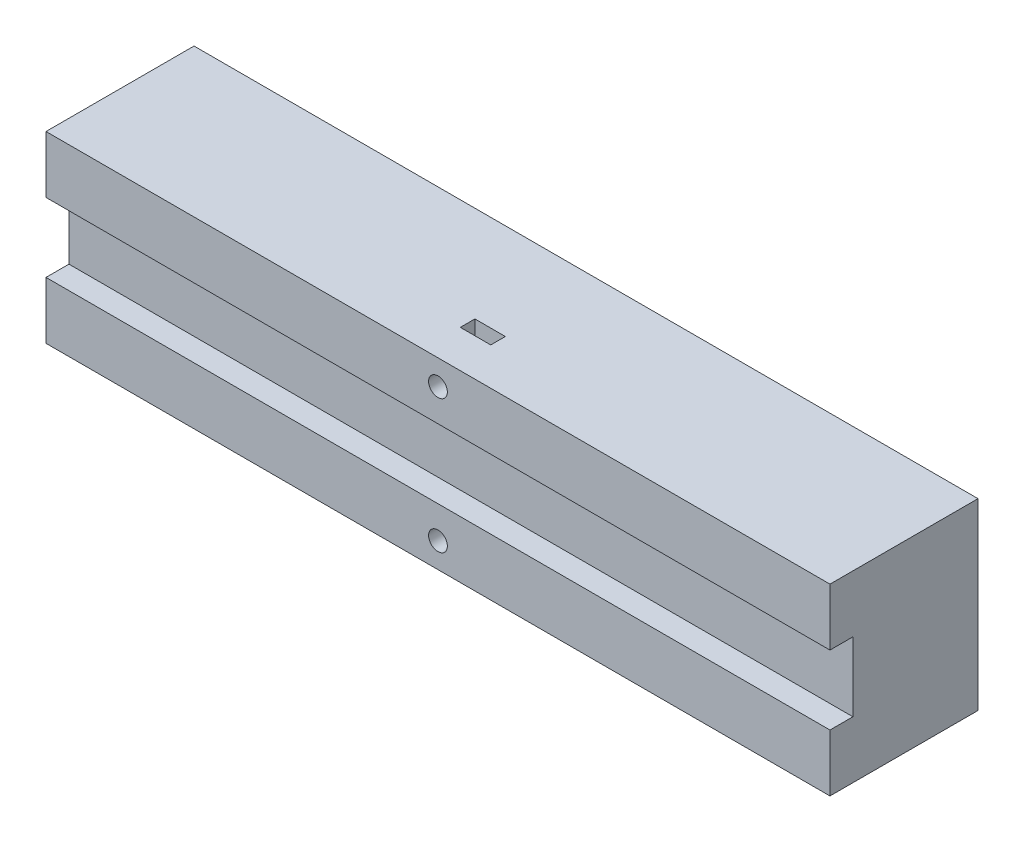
ISO-10303-21;
HEADER;
FILE_DESCRIPTION(('STEP AP214'),'2;1');
FILE_NAME('part.step','',(''),(''),'','','');
FILE_SCHEMA(('AUTOMOTIVE_DESIGN { 1 0 10303 214 1 1 1 1 }'));
ENDSEC;
DATA;
#1=APPLICATION_CONTEXT('core data for automotive mechanical design processes');
#2=APPLICATION_PROTOCOL_DEFINITION('international standard','automotive_design',2000,#1);
#3=PRODUCT_CONTEXT('',#1,'mechanical');
#4=PRODUCT('Part','Part','',(#3));
#5=PRODUCT_RELATED_PRODUCT_CATEGORY('part','',(#4));
#6=PRODUCT_DEFINITION_FORMATION('','',#4);
#7=PRODUCT_DEFINITION_CONTEXT('part definition',#1,'design');
#8=PRODUCT_DEFINITION('design','',#6,#7);
#9=PRODUCT_DEFINITION_SHAPE('','',#8);
#10=(LENGTH_UNIT() NAMED_UNIT(*) SI_UNIT(.MILLI.,.METRE.));
#11=(NAMED_UNIT(*) PLANE_ANGLE_UNIT() SI_UNIT($,.RADIAN.));
#12=(NAMED_UNIT(*) SI_UNIT($,.STERADIAN.) SOLID_ANGLE_UNIT());
#13=UNCERTAINTY_MEASURE_WITH_UNIT(LENGTH_MEASURE(1.E-05),#10,'distance_accuracy_value','');
#14=(GEOMETRIC_REPRESENTATION_CONTEXT(3) GLOBAL_UNCERTAINTY_ASSIGNED_CONTEXT((#13)) GLOBAL_UNIT_ASSIGNED_CONTEXT((#10,
#11,#12)) REPRESENTATION_CONTEXT('',''));
#15=CARTESIAN_POINT('',(0.,0.,0.));
#16=DIRECTION('',(0.,0.,1.));
#17=DIRECTION('',(1.,0.,0.));
#18=AXIS2_PLACEMENT_3D('',#15,#16,#17);
#19=CARTESIAN_POINT('',(0.,0.,23.));
#20=DIRECTION('',(0.,0.,1.));
#21=DIRECTION('',(1.,0.,0.));
#22=AXIS2_PLACEMENT_3D('',#19,#20,#21);
#23=PLANE('',#22);
#24=DIRECTION('',(0.,1.,0.));
#25=VECTOR('',#24,1.);
#26=CARTESIAN_POINT('',(-3.65,11.75,23.));
#27=LINE('',#26,#25);
#28=CARTESIAN_POINT('',(-3.65,11.75,23.));
#29=VERTEX_POINT('',#28);
#30=CARTESIAN_POINT('',(-3.65,22.,23.));
#31=VERTEX_POINT('',#30);
#32=EDGE_CURVE('E230',#29,#31,#27,.T.);
#33=ORIENTED_EDGE('',*,*,#32,.F.);
#34=DIRECTION('',(-1.,0.,0.));
#35=VECTOR('',#34,1.);
#36=CARTESIAN_POINT('',(3.65,11.75,23.));
#37=LINE('',#36,#35);
#38=CARTESIAN_POINT('',(3.65,11.75,23.));
#39=VERTEX_POINT('',#38);
#40=EDGE_CURVE('E257',#39,#29,#37,.T.);
#41=ORIENTED_EDGE('',*,*,#40,.F.);
#42=DIRECTION('',(0.,-1.,0.));
#43=VECTOR('',#42,1.);
#44=CARTESIAN_POINT('',(3.65,22.,23.));
#45=LINE('',#44,#43);
#46=CARTESIAN_POINT('',(3.65,22.,23.));
#47=VERTEX_POINT('',#46);
#48=EDGE_CURVE('E254',#47,#39,#45,.T.);
#49=ORIENTED_EDGE('',*,*,#48,.F.);
#50=DIRECTION('',(-1.,0.,0.));
#51=VECTOR('',#50,1.);
#52=CARTESIAN_POINT('',(94.,22.,23.));
#53=LINE('',#52,#51);
#54=EDGE_CURVE('E299',#47,#31,#53,.T.);
#55=ORIENTED_EDGE('',*,*,#54,.T.);
#56=EDGE_LOOP('',(#33,#41,#49,#55));
#57=FACE_BOUND('',#56,.T.);
#58=CARTESIAN_POINT('',(0.,16.,23.));
#59=DIRECTION('',(0.,0.,1.));
#60=DIRECTION('',(1.,0.,0.));
#61=AXIS2_PLACEMENT_3D('',#58,#59,#60);
#62=CIRCLE('',#61,2.25);
#63=CARTESIAN_POINT('',(2.25,16.,23.));
#64=VERTEX_POINT('',#63);
#65=EDGE_CURVE('E286',#64,#64,#62,.T.);
#66=ORIENTED_EDGE('',*,*,#65,.F.);
#67=EDGE_LOOP('',(#66));
#68=FACE_BOUND('',#67,.T.);
#69=ADVANCED_FACE('F43',(#57,#68),#23,.T.);
#70=DIRECTION('',(0.,-1.,0.));
#71=VECTOR('',#70,1.);
#72=CARTESIAN_POINT('',(3.65,-11.75,23.));
#73=LINE('',#72,#71);
#74=CARTESIAN_POINT('',(3.65,-11.75,23.));
#75=VERTEX_POINT('',#74);
#76=CARTESIAN_POINT('',(3.65,-22.,23.));
#77=VERTEX_POINT('',#76);
#78=EDGE_CURVE('E251',#75,#77,#73,.T.);
#79=ORIENTED_EDGE('',*,*,#78,.F.);
#80=DIRECTION('',(1.,0.,0.));
#81=VECTOR('',#80,1.);
#82=CARTESIAN_POINT('',(-3.65,-11.75,23.));
#83=LINE('',#82,#81);
#84=CARTESIAN_POINT('',(-3.65,-11.75,23.));
#85=VERTEX_POINT('',#84);
#86=EDGE_CURVE('E248',#85,#75,#83,.T.);
#87=ORIENTED_EDGE('',*,*,#86,.F.);
#88=DIRECTION('',(0.,1.,0.));
#89=VECTOR('',#88,1.);
#90=CARTESIAN_POINT('',(-3.65,-22.,23.));
#91=LINE('',#90,#89);
#92=CARTESIAN_POINT('',(-3.65,-22.,23.));
#93=VERTEX_POINT('',#92);
#94=EDGE_CURVE('E221',#93,#85,#91,.T.);
#95=ORIENTED_EDGE('',*,*,#94,.F.);
#96=DIRECTION('',(1.,0.,0.));
#97=VECTOR('',#96,1.);
#98=CARTESIAN_POINT('',(-94.,-22.,23.));
#99=LINE('',#98,#97);
#100=EDGE_CURVE('E297',#93,#77,#99,.T.);
#101=ORIENTED_EDGE('',*,*,#100,.T.);
#102=EDGE_LOOP('',(#79,#87,#95,#101));
#103=FACE_BOUND('',#102,.T.);
#104=CARTESIAN_POINT('',(0.,-16.,23.));
#105=DIRECTION('',(0.,0.,1.));
#106=DIRECTION('',(1.,0.,0.));
#107=AXIS2_PLACEMENT_3D('',#104,#105,#106);
#108=CIRCLE('',#107,2.25);
#109=CARTESIAN_POINT('',(2.25,-16.,23.));
#110=VERTEX_POINT('',#109);
#111=EDGE_CURVE('E292',#110,#110,#108,.T.);
#112=ORIENTED_EDGE('',*,*,#111,.F.);
#113=EDGE_LOOP('',(#112));
#114=FACE_BOUND('',#113,.T.);
#115=ADVANCED_FACE('F344',(#103,#114),#23,.T.);
#116=CARTESIAN_POINT('',(0.,0.,0.));
#117=DIRECTION('',(0.,0.,1.));
#118=DIRECTION('',(1.,0.,0.));
#119=AXIS2_PLACEMENT_3D('',#116,#117,#118);
#120=PLANE('',#119);
#121=DIRECTION('',(0.,-1.,0.));
#122=VECTOR('',#121,1.);
#123=CARTESIAN_POINT('',(-94.,22.,0.));
#124=LINE('',#123,#122);
#125=CARTESIAN_POINT('',(-94.,22.,0.));
#126=VERTEX_POINT('',#125);
#127=CARTESIAN_POINT('',(-94.,-22.,0.));
#128=VERTEX_POINT('',#127);
#129=EDGE_CURVE('E161',#126,#128,#124,.T.);
#130=ORIENTED_EDGE('',*,*,#129,.F.);
#131=DIRECTION('',(-1.,0.,0.));
#132=VECTOR('',#131,1.);
#133=CARTESIAN_POINT('',(94.,22.,0.));
#134=LINE('',#133,#132);
#135=CARTESIAN_POINT('',(94.,22.,0.));
#136=VERTEX_POINT('',#135);
#137=EDGE_CURVE('E300',#136,#126,#134,.T.);
#138=ORIENTED_EDGE('',*,*,#137,.F.);
#139=DIRECTION('',(0.,1.,0.));
#140=VECTOR('',#139,1.);
#141=CARTESIAN_POINT('',(94.,-22.,0.));
#142=LINE('',#141,#140);
#143=CARTESIAN_POINT('',(94.,-22.,0.));
#144=VERTEX_POINT('',#143);
#145=EDGE_CURVE('E306',#144,#136,#142,.T.);
#146=ORIENTED_EDGE('',*,*,#145,.F.);
#147=DIRECTION('',(1.,0.,0.));
#148=VECTOR('',#147,1.);
#149=CARTESIAN_POINT('',(-94.,-22.,0.));
#150=LINE('',#149,#148);
#151=EDGE_CURVE('E304',#128,#144,#150,.T.);
#152=ORIENTED_EDGE('',*,*,#151,.F.);
#153=EDGE_LOOP('',(#130,#138,#146,#152));
#154=FACE_BOUND('',#153,.T.);
#155=CARTESIAN_POINT('',(0.,-16.,0.));
#156=DIRECTION('',(0.,0.,1.));
#157=DIRECTION('',(1.,0.,0.));
#158=AXIS2_PLACEMENT_3D('',#155,#156,#157);
#159=CIRCLE('',#158,2.25);
#160=CARTESIAN_POINT('',(2.25,-16.,0.));
#161=VERTEX_POINT('',#160);
#162=EDGE_CURVE('E289',#161,#161,#159,.T.);
#163=ORIENTED_EDGE('',*,*,#162,.T.);
#164=EDGE_LOOP('',(#163));
#165=FACE_BOUND('',#164,.T.);
#166=CARTESIAN_POINT('',(0.,16.,0.));
#167=DIRECTION('',(0.,0.,1.));
#168=DIRECTION('',(1.,0.,0.));
#169=AXIS2_PLACEMENT_3D('',#166,#167,#168);
#170=CIRCLE('',#169,2.25);
#171=CARTESIAN_POINT('',(2.25,16.,0.));
#172=VERTEX_POINT('',#171);
#173=EDGE_CURVE('E285',#172,#172,#170,.T.);
#174=ORIENTED_EDGE('',*,*,#173,.T.);
#175=EDGE_LOOP('',(#174));
#176=FACE_BOUND('',#175,.T.);
#177=ADVANCED_FACE('F318',(#154,#165,#176),#120,.F.);
#178=CARTESIAN_POINT('',(-94.,22.,23.));
#179=DIRECTION('',(1.,0.,0.));
#180=DIRECTION('',(0.,0.,-1.));
#181=AXIS2_PLACEMENT_3D('',#178,#179,#180);
#182=PLANE('',#181);
#183=ORIENTED_EDGE('',*,*,#129,.T.);
#184=DIRECTION('',(0.,0.,-1.));
#185=VECTOR('',#184,1.);
#186=CARTESIAN_POINT('',(-94.,-22.,23.));
#187=LINE('',#186,#185);
#188=CARTESIAN_POINT('',(-94.,-22.,35.5));
#189=VERTEX_POINT('',#188);
#190=EDGE_CURVE('E11',#189,#128,#187,.T.);
#191=ORIENTED_EDGE('',*,*,#190,.F.);
#192=DIRECTION('',(0.,-1.,0.));
#193=VECTOR('',#192,1.);
#194=CARTESIAN_POINT('',(-94.,-8.3,35.5));
#195=LINE('',#194,#193);
#196=CARTESIAN_POINT('',(-94.,-8.3,35.5));
#197=VERTEX_POINT('',#196);
#198=EDGE_CURVE('E158',#197,#189,#195,.T.);
#199=ORIENTED_EDGE('',*,*,#198,.F.);
#200=DIRECTION('',(0.,0.,-1.));
#201=VECTOR('',#200,1.);
#202=CARTESIAN_POINT('',(-94.,-8.3,35.5));
#203=LINE('',#202,#201);
#204=CARTESIAN_POINT('',(-94.,-8.3,30.));
#205=VERTEX_POINT('',#204);
#206=EDGE_CURVE('E182',#197,#205,#203,.T.);
#207=ORIENTED_EDGE('',*,*,#206,.T.);
#208=DIRECTION('',(0.,-1.,0.));
#209=VECTOR('',#208,1.);
#210=CARTESIAN_POINT('',(-94.,22.,30.));
#211=LINE('',#210,#209);
#212=CARTESIAN_POINT('',(-94.,8.3,30.));
#213=VERTEX_POINT('',#212);
#214=EDGE_CURVE('E216',#213,#205,#211,.T.);
#215=ORIENTED_EDGE('',*,*,#214,.F.);
#216=DIRECTION('',(0.,0.,-1.));
#217=VECTOR('',#216,1.);
#218=CARTESIAN_POINT('',(-94.,8.3,35.5));
#219=LINE('',#218,#217);
#220=CARTESIAN_POINT('',(-94.,8.3,35.5));
#221=VERTEX_POINT('',#220);
#222=EDGE_CURVE('E189',#221,#213,#219,.T.);
#223=ORIENTED_EDGE('',*,*,#222,.F.);
#224=DIRECTION('',(0.,-1.,0.));
#225=VECTOR('',#224,1.);
#226=CARTESIAN_POINT('',(-94.,22.,35.5));
#227=LINE('',#226,#225);
#228=CARTESIAN_POINT('',(-94.,22.,35.5));
#229=VERTEX_POINT('',#228);
#230=EDGE_CURVE('E198',#229,#221,#227,.T.);
#231=ORIENTED_EDGE('',*,*,#230,.F.);
#232=DIRECTION('',(0.,0.,-1.));
#233=VECTOR('',#232,1.);
#234=CARTESIAN_POINT('',(-94.,22.,23.));
#235=LINE('',#234,#233);
#236=EDGE_CURVE('E302',#229,#126,#235,.T.);
#237=ORIENTED_EDGE('',*,*,#236,.T.);
#238=EDGE_LOOP('',(#183,#191,#199,#207,#215,#223,#231,#237));
#239=FACE_BOUND('',#238,.T.);
#240=ADVANCED_FACE('F45',(#239),#182,.F.);
#241=CARTESIAN_POINT('',(-94.,-22.,23.));
#242=DIRECTION('',(0.,1.,0.));
#243=DIRECTION('',(0.,0.,1.));
#244=AXIS2_PLACEMENT_3D('',#241,#242,#243);
#245=PLANE('',#244);
#246=DIRECTION('',(0.,0.,-1.));
#247=VECTOR('',#246,1.);
#248=CARTESIAN_POINT('',(-3.65,-22.,26.5));
#249=LINE('',#248,#247);
#250=CARTESIAN_POINT('',(-3.65,-22.,26.5));
#251=VERTEX_POINT('',#250);
#252=EDGE_CURVE('E282',#251,#93,#249,.T.);
#253=ORIENTED_EDGE('',*,*,#252,.F.);
#254=DIRECTION('',(1.,0.,0.));
#255=VECTOR('',#254,1.);
#256=CARTESIAN_POINT('',(-94.,-22.,26.5));
#257=LINE('',#256,#255);
#258=CARTESIAN_POINT('',(3.65,-22.,26.5));
#259=VERTEX_POINT('',#258);
#260=EDGE_CURVE('E215',#251,#259,#257,.T.);
#261=ORIENTED_EDGE('',*,*,#260,.T.);
#262=DIRECTION('',(0.,0.,-1.));
#263=VECTOR('',#262,1.);
#264=CARTESIAN_POINT('',(3.65,-22.,26.5));
#265=LINE('',#264,#263);
#266=EDGE_CURVE('E273',#259,#77,#265,.T.);
#267=ORIENTED_EDGE('',*,*,#266,.T.);
#268=ORIENTED_EDGE('',*,*,#100,.F.);
#269=EDGE_LOOP('',(#253,#261,#267,#268));
#270=FACE_BOUND('',#269,.T.);
#271=ORIENTED_EDGE('',*,*,#151,.T.);
#272=DIRECTION('',(0.,0.,-1.));
#273=VECTOR('',#272,1.);
#274=CARTESIAN_POINT('',(94.,-22.,23.));
#275=LINE('',#274,#273);
#276=CARTESIAN_POINT('',(94.,-22.,35.5));
#277=VERTEX_POINT('',#276);
#278=EDGE_CURVE('E51',#277,#144,#275,.T.);
#279=ORIENTED_EDGE('',*,*,#278,.F.);
#280=DIRECTION('',(1.,0.,0.));
#281=VECTOR('',#280,1.);
#282=CARTESIAN_POINT('',(-94.,-22.,35.5));
#283=LINE('',#282,#281);
#284=EDGE_CURVE('E164',#189,#277,#283,.T.);
#285=ORIENTED_EDGE('',*,*,#284,.F.);
#286=ORIENTED_EDGE('',*,*,#190,.T.);
#287=EDGE_LOOP('',(#271,#279,#285,#286));
#288=FACE_BOUND('',#287,.T.);
#289=ADVANCED_FACE('F165',(#270,#288),#245,.F.);
#290=CARTESIAN_POINT('',(94.,-22.,23.));
#291=DIRECTION('',(-1.,0.,0.));
#292=DIRECTION('',(0.,0.,1.));
#293=AXIS2_PLACEMENT_3D('',#290,#291,#292);
#294=PLANE('',#293);
#295=ORIENTED_EDGE('',*,*,#145,.T.);
#296=DIRECTION('',(0.,0.,-1.));
#297=VECTOR('',#296,1.);
#298=CARTESIAN_POINT('',(94.,22.,23.));
#299=LINE('',#298,#297);
#300=CARTESIAN_POINT('',(94.,22.,35.5));
#301=VERTEX_POINT('',#300);
#302=EDGE_CURVE('E310',#301,#136,#299,.T.);
#303=ORIENTED_EDGE('',*,*,#302,.F.);
#304=DIRECTION('',(0.,1.,0.));
#305=VECTOR('',#304,1.);
#306=CARTESIAN_POINT('',(94.,8.3,35.5));
#307=LINE('',#306,#305);
#308=CARTESIAN_POINT('',(94.,8.3,35.5));
#309=VERTEX_POINT('',#308);
#310=EDGE_CURVE('E201',#309,#301,#307,.T.);
#311=ORIENTED_EDGE('',*,*,#310,.F.);
#312=DIRECTION('',(0.,0.,-1.));
#313=VECTOR('',#312,1.);
#314=CARTESIAN_POINT('',(94.,8.3,35.5));
#315=LINE('',#314,#313);
#316=CARTESIAN_POINT('',(94.,8.3,30.));
#317=VERTEX_POINT('',#316);
#318=EDGE_CURVE('E192',#309,#317,#315,.T.);
#319=ORIENTED_EDGE('',*,*,#318,.T.);
#320=DIRECTION('',(0.,1.,0.));
#321=VECTOR('',#320,1.);
#322=CARTESIAN_POINT('',(94.,-22.,30.));
#323=LINE('',#322,#321);
#324=CARTESIAN_POINT('',(94.,-8.3,30.));
#325=VERTEX_POINT('',#324);
#326=EDGE_CURVE('E218',#325,#317,#323,.T.);
#327=ORIENTED_EDGE('',*,*,#326,.F.);
#328=DIRECTION('',(0.,0.,-1.));
#329=VECTOR('',#328,1.);
#330=CARTESIAN_POINT('',(94.,-8.3,35.5));
#331=LINE('',#330,#329);
#332=CARTESIAN_POINT('',(94.,-8.3,35.5));
#333=VERTEX_POINT('',#332);
#334=EDGE_CURVE('E185',#333,#325,#331,.T.);
#335=ORIENTED_EDGE('',*,*,#334,.F.);
#336=DIRECTION('',(0.,1.,0.));
#337=VECTOR('',#336,1.);
#338=CARTESIAN_POINT('',(94.,-22.,35.5));
#339=LINE('',#338,#337);
#340=EDGE_CURVE('E169',#277,#333,#339,.T.);
#341=ORIENTED_EDGE('',*,*,#340,.F.);
#342=ORIENTED_EDGE('',*,*,#278,.T.);
#343=EDGE_LOOP('',(#295,#303,#311,#319,#327,#335,#341,#342));
#344=FACE_BOUND('',#343,.T.);
#345=ADVANCED_FACE('F314',(#344),#294,.F.);
#346=CARTESIAN_POINT('',(94.,22.,23.));
#347=DIRECTION('',(0.,-1.,0.));
#348=DIRECTION('',(0.,0.,-1.));
#349=AXIS2_PLACEMENT_3D('',#346,#347,#348);
#350=PLANE('',#349);
#351=DIRECTION('',(0.,0.,-1.));
#352=VECTOR('',#351,1.);
#353=CARTESIAN_POINT('',(3.65,22.,26.5));
#354=LINE('',#353,#352);
#355=CARTESIAN_POINT('',(3.65,22.,26.5));
#356=VERTEX_POINT('',#355);
#357=EDGE_CURVE('E270',#356,#47,#354,.T.);
#358=ORIENTED_EDGE('',*,*,#357,.F.);
#359=DIRECTION('',(-1.,0.,0.));
#360=VECTOR('',#359,1.);
#361=CARTESIAN_POINT('',(94.,22.,26.5));
#362=LINE('',#361,#360);
#363=CARTESIAN_POINT('',(-3.65,22.,26.5));
#364=VERTEX_POINT('',#363);
#365=EDGE_CURVE('E219',#356,#364,#362,.T.);
#366=ORIENTED_EDGE('',*,*,#365,.T.);
#367=DIRECTION('',(0.,0.,-1.));
#368=VECTOR('',#367,1.);
#369=CARTESIAN_POINT('',(-3.65,22.,26.5));
#370=LINE('',#369,#368);
#371=EDGE_CURVE('E245',#364,#31,#370,.T.);
#372=ORIENTED_EDGE('',*,*,#371,.T.);
#373=ORIENTED_EDGE('',*,*,#54,.F.);
#374=EDGE_LOOP('',(#358,#366,#372,#373));
#375=FACE_BOUND('',#374,.T.);
#376=ORIENTED_EDGE('',*,*,#137,.T.);
#377=ORIENTED_EDGE('',*,*,#236,.F.);
#378=DIRECTION('',(-1.,0.,0.));
#379=VECTOR('',#378,1.);
#380=CARTESIAN_POINT('',(94.,22.,35.5));
#381=LINE('',#380,#379);
#382=EDGE_CURVE('E195',#301,#229,#381,.T.);
#383=ORIENTED_EDGE('',*,*,#382,.F.);
#384=ORIENTED_EDGE('',*,*,#302,.T.);
#385=EDGE_LOOP('',(#376,#377,#383,#384));
#386=FACE_BOUND('',#385,.T.);
#387=ADVANCED_FACE('F321',(#375,#386),#350,.F.);
#388=CARTESIAN_POINT('',(0.,-16.,23.));
#389=DIRECTION('',(0.,0.,-1.));
#390=DIRECTION('',(-1.,0.,0.));
#391=AXIS2_PLACEMENT_3D('',#388,#389,#390);
#392=CYLINDRICAL_SURFACE('',#391,2.25);
#393=ORIENTED_EDGE('',*,*,#111,.T.);
#394=EDGE_LOOP('',(#393));
#395=FACE_BOUND('',#394,.T.);
#396=ORIENTED_EDGE('',*,*,#162,.F.);
#397=EDGE_LOOP('',(#396));
#398=FACE_BOUND('',#397,.T.);
#399=ADVANCED_FACE('F355',(#395,#398),#392,.F.);
#400=CARTESIAN_POINT('',(0.,16.,23.));
#401=DIRECTION('',(0.,0.,-1.));
#402=DIRECTION('',(-1.,0.,0.));
#403=AXIS2_PLACEMENT_3D('',#400,#401,#402);
#404=CYLINDRICAL_SURFACE('',#403,2.25);
#405=ORIENTED_EDGE('',*,*,#65,.T.);
#406=EDGE_LOOP('',(#405));
#407=FACE_BOUND('',#406,.T.);
#408=ORIENTED_EDGE('',*,*,#173,.F.);
#409=EDGE_LOOP('',(#408));
#410=FACE_BOUND('',#409,.T.);
#411=ADVANCED_FACE('F390',(#407,#410),#404,.F.);
#412=CARTESIAN_POINT('',(-3.65,-22.,26.5));
#413=DIRECTION('',(-1.,0.,0.));
#414=DIRECTION('',(0.,0.,1.));
#415=AXIS2_PLACEMENT_3D('',#412,#413,#414);
#416=PLANE('',#415);
#417=ORIENTED_EDGE('',*,*,#94,.T.);
#418=DIRECTION('',(0.,0.,-1.));
#419=VECTOR('',#418,1.);
#420=CARTESIAN_POINT('',(-3.65,-11.75,26.5));
#421=LINE('',#420,#419);
#422=CARTESIAN_POINT('',(-3.65,-11.75,26.5));
#423=VERTEX_POINT('',#422);
#424=EDGE_CURVE('E279',#423,#85,#421,.T.);
#425=ORIENTED_EDGE('',*,*,#424,.F.);
#426=DIRECTION('',(0.,1.,0.));
#427=VECTOR('',#426,1.);
#428=CARTESIAN_POINT('',(-3.65,-22.,26.5));
#429=LINE('',#428,#427);
#430=EDGE_CURVE('E226',#251,#423,#429,.T.);
#431=ORIENTED_EDGE('',*,*,#430,.F.);
#432=ORIENTED_EDGE('',*,*,#252,.T.);
#433=EDGE_LOOP('',(#417,#425,#431,#432));
#434=FACE_BOUND('',#433,.T.);
#435=ADVANCED_FACE('F372',(#434),#416,.F.);
#436=CARTESIAN_POINT('',(-3.65,-11.75,26.5));
#437=DIRECTION('',(0.,1.,0.));
#438=DIRECTION('',(0.,0.,1.));
#439=AXIS2_PLACEMENT_3D('',#436,#437,#438);
#440=PLANE('',#439);
#441=ORIENTED_EDGE('',*,*,#86,.T.);
#442=DIRECTION('',(0.,0.,-1.));
#443=VECTOR('',#442,1.);
#444=CARTESIAN_POINT('',(3.65,-11.75,26.5));
#445=LINE('',#444,#443);
#446=CARTESIAN_POINT('',(3.65,-11.75,26.5));
#447=VERTEX_POINT('',#446);
#448=EDGE_CURVE('E276',#447,#75,#445,.T.);
#449=ORIENTED_EDGE('',*,*,#448,.F.);
#450=DIRECTION('',(1.,0.,0.));
#451=VECTOR('',#450,1.);
#452=CARTESIAN_POINT('',(-3.65,-11.75,26.5));
#453=LINE('',#452,#451);
#454=EDGE_CURVE('E229',#423,#447,#453,.T.);
#455=ORIENTED_EDGE('',*,*,#454,.F.);
#456=ORIENTED_EDGE('',*,*,#424,.T.);
#457=EDGE_LOOP('',(#441,#449,#455,#456));
#458=FACE_BOUND('',#457,.T.);
#459=ADVANCED_FACE('F381',(#458),#440,.F.);
#460=CARTESIAN_POINT('',(3.65,-11.75,26.5));
#461=DIRECTION('',(1.,0.,0.));
#462=DIRECTION('',(0.,0.,-1.));
#463=AXIS2_PLACEMENT_3D('',#460,#461,#462);
#464=PLANE('',#463);
#465=ORIENTED_EDGE('',*,*,#78,.T.);
#466=ORIENTED_EDGE('',*,*,#266,.F.);
#467=DIRECTION('',(0.,-1.,0.));
#468=VECTOR('',#467,1.);
#469=CARTESIAN_POINT('',(3.65,-11.75,26.5));
#470=LINE('',#469,#468);
#471=EDGE_CURVE('E233',#447,#259,#470,.T.);
#472=ORIENTED_EDGE('',*,*,#471,.F.);
#473=ORIENTED_EDGE('',*,*,#448,.T.);
#474=EDGE_LOOP('',(#465,#466,#472,#473));
#475=FACE_BOUND('',#474,.T.);
#476=ADVANCED_FACE('F378',(#475),#464,.F.);
#477=CARTESIAN_POINT('',(3.65,22.,26.5));
#478=DIRECTION('',(1.,0.,0.));
#479=DIRECTION('',(0.,0.,-1.));
#480=AXIS2_PLACEMENT_3D('',#477,#478,#479);
#481=PLANE('',#480);
#482=ORIENTED_EDGE('',*,*,#48,.T.);
#483=DIRECTION('',(0.,0.,-1.));
#484=VECTOR('',#483,1.);
#485=CARTESIAN_POINT('',(3.65,11.75,26.5));
#486=LINE('',#485,#484);
#487=CARTESIAN_POINT('',(3.65,11.75,26.5));
#488=VERTEX_POINT('',#487);
#489=EDGE_CURVE('E267',#488,#39,#486,.T.);
#490=ORIENTED_EDGE('',*,*,#489,.F.);
#491=DIRECTION('',(0.,-1.,0.));
#492=VECTOR('',#491,1.);
#493=CARTESIAN_POINT('',(3.65,22.,26.5));
#494=LINE('',#493,#492);
#495=EDGE_CURVE('E236',#356,#488,#494,.T.);
#496=ORIENTED_EDGE('',*,*,#495,.F.);
#497=ORIENTED_EDGE('',*,*,#357,.T.);
#498=EDGE_LOOP('',(#482,#490,#496,#497));
#499=FACE_BOUND('',#498,.T.);
#500=ADVANCED_FACE('F388',(#499),#481,.F.);
#501=CARTESIAN_POINT('',(3.65,11.75,26.5));
#502=DIRECTION('',(0.,-1.,0.));
#503=DIRECTION('',(0.,0.,-1.));
#504=AXIS2_PLACEMENT_3D('',#501,#502,#503);
#505=PLANE('',#504);
#506=ORIENTED_EDGE('',*,*,#40,.T.);
#507=DIRECTION('',(0.,0.,-1.));
#508=VECTOR('',#507,1.);
#509=CARTESIAN_POINT('',(-3.65,11.75,26.5));
#510=LINE('',#509,#508);
#511=CARTESIAN_POINT('',(-3.65,11.75,26.5));
#512=VERTEX_POINT('',#511);
#513=EDGE_CURVE('E264',#512,#29,#510,.T.);
#514=ORIENTED_EDGE('',*,*,#513,.F.);
#515=DIRECTION('',(-1.,0.,0.));
#516=VECTOR('',#515,1.);
#517=CARTESIAN_POINT('',(3.65,11.75,26.5));
#518=LINE('',#517,#516);
#519=EDGE_CURVE('E239',#488,#512,#518,.T.);
#520=ORIENTED_EDGE('',*,*,#519,.F.);
#521=ORIENTED_EDGE('',*,*,#489,.T.);
#522=EDGE_LOOP('',(#506,#514,#520,#521));
#523=FACE_BOUND('',#522,.T.);
#524=ADVANCED_FACE('F486',(#523),#505,.F.);
#525=CARTESIAN_POINT('',(-3.65,11.75,26.5));
#526=DIRECTION('',(-1.,0.,0.));
#527=DIRECTION('',(0.,0.,1.));
#528=AXIS2_PLACEMENT_3D('',#525,#526,#527);
#529=PLANE('',#528);
#530=ORIENTED_EDGE('',*,*,#32,.T.);
#531=ORIENTED_EDGE('',*,*,#371,.F.);
#532=DIRECTION('',(0.,1.,0.));
#533=VECTOR('',#532,1.);
#534=CARTESIAN_POINT('',(-3.65,11.75,26.5));
#535=LINE('',#534,#533);
#536=EDGE_CURVE('E242',#512,#364,#535,.T.);
#537=ORIENTED_EDGE('',*,*,#536,.F.);
#538=ORIENTED_EDGE('',*,*,#513,.T.);
#539=EDGE_LOOP('',(#530,#531,#537,#538));
#540=FACE_BOUND('',#539,.T.);
#541=ADVANCED_FACE('F495',(#540),#529,.F.);
#542=CARTESIAN_POINT('',(0.,0.,26.5));
#543=DIRECTION('',(0.,0.,1.));
#544=DIRECTION('',(1.,0.,0.));
#545=AXIS2_PLACEMENT_3D('',#542,#543,#544);
#546=PLANE('',#545);
#547=CARTESIAN_POINT('',(0.,-16.,26.5));
#548=DIRECTION('',(0.,0.,1.));
#549=DIRECTION('',(1.,0.,0.));
#550=AXIS2_PLACEMENT_3D('',#547,#548,#549);
#551=CIRCLE('',#550,2.25);
#552=CARTESIAN_POINT('',(2.25,-16.,26.5));
#553=VERTEX_POINT('',#552);
#554=EDGE_CURVE('E212',#553,#553,#551,.T.);
#555=ORIENTED_EDGE('',*,*,#554,.T.);
#556=EDGE_LOOP('',(#555));
#557=FACE_BOUND('',#556,.T.);
#558=ORIENTED_EDGE('',*,*,#260,.F.);
#559=ORIENTED_EDGE('',*,*,#430,.T.);
#560=ORIENTED_EDGE('',*,*,#454,.T.);
#561=ORIENTED_EDGE('',*,*,#471,.T.);
#562=EDGE_LOOP('',(#558,#559,#560,#561));
#563=FACE_BOUND('',#562,.T.);
#564=ADVANCED_FACE('F375',(#557,#563),#546,.F.);
#565=CARTESIAN_POINT('',(0.,16.,26.5));
#566=DIRECTION('',(0.,0.,1.));
#567=DIRECTION('',(1.,0.,0.));
#568=AXIS2_PLACEMENT_3D('',#565,#566,#567);
#569=CIRCLE('',#568,2.25);
#570=CARTESIAN_POINT('',(2.25,16.,26.5));
#571=VERTEX_POINT('',#570);
#572=EDGE_CURVE('E188',#571,#571,#569,.T.);
#573=ORIENTED_EDGE('',*,*,#572,.T.);
#574=EDGE_LOOP('',(#573));
#575=FACE_BOUND('',#574,.T.);
#576=ORIENTED_EDGE('',*,*,#365,.F.);
#577=ORIENTED_EDGE('',*,*,#495,.T.);
#578=ORIENTED_EDGE('',*,*,#519,.T.);
#579=ORIENTED_EDGE('',*,*,#536,.T.);
#580=EDGE_LOOP('',(#576,#577,#578,#579));
#581=FACE_BOUND('',#580,.T.);
#582=ADVANCED_FACE('F585',(#575,#581),#546,.F.);
#583=CARTESIAN_POINT('',(0.,0.,30.));
#584=DIRECTION('',(0.,0.,1.));
#585=DIRECTION('',(1.,0.,0.));
#586=AXIS2_PLACEMENT_3D('',#583,#584,#585);
#587=PLANE('',#586);
#588=DIRECTION('',(-1.,0.,0.));
#589=VECTOR('',#588,1.);
#590=CARTESIAN_POINT('',(94.,-8.3,30.));
#591=LINE('',#590,#589);
#592=EDGE_CURVE('E58',#325,#205,#591,.T.);
#593=ORIENTED_EDGE('',*,*,#592,.F.);
#594=ORIENTED_EDGE('',*,*,#326,.T.);
#595=DIRECTION('',(1.,0.,0.));
#596=VECTOR('',#595,1.);
#597=CARTESIAN_POINT('',(-94.,8.3,30.));
#598=LINE('',#597,#596);
#599=EDGE_CURVE('E63',#213,#317,#598,.T.);
#600=ORIENTED_EDGE('',*,*,#599,.F.);
#601=ORIENTED_EDGE('',*,*,#214,.T.);
#602=EDGE_LOOP('',(#593,#594,#600,#601));
#603=FACE_BOUND('',#602,.T.);
#604=ADVANCED_FACE('F544',(#603),#587,.T.);
#605=CARTESIAN_POINT('',(0.,-16.,30.));
#606=DIRECTION('',(0.,0.,-1.));
#607=DIRECTION('',(-1.,0.,0.));
#608=AXIS2_PLACEMENT_3D('',#605,#606,#607);
#609=CYLINDRICAL_SURFACE('',#608,2.25);
#610=ORIENTED_EDGE('',*,*,#554,.F.);
#611=EDGE_LOOP('',(#610));
#612=FACE_BOUND('',#611,.T.);
#613=CARTESIAN_POINT('',(0.,-16.,35.5));
#614=DIRECTION('',(0.,0.,1.));
#615=DIRECTION('',(1.,0.,0.));
#616=AXIS2_PLACEMENT_3D('',#613,#614,#615);
#617=CIRCLE('',#616,2.25);
#618=CARTESIAN_POINT('',(2.25,-16.,35.5));
#619=VERTEX_POINT('',#618);
#620=EDGE_CURVE('E177',#619,#619,#617,.T.);
#621=ORIENTED_EDGE('',*,*,#620,.T.);
#622=EDGE_LOOP('',(#621));
#623=FACE_BOUND('',#622,.T.);
#624=ADVANCED_FACE('F538',(#612,#623),#609,.F.);
#625=CARTESIAN_POINT('',(0.,16.,30.));
#626=DIRECTION('',(0.,0.,-1.));
#627=DIRECTION('',(-1.,0.,0.));
#628=AXIS2_PLACEMENT_3D('',#625,#626,#627);
#629=CYLINDRICAL_SURFACE('',#628,2.25);
#630=ORIENTED_EDGE('',*,*,#572,.F.);
#631=EDGE_LOOP('',(#630));
#632=FACE_BOUND('',#631,.T.);
#633=CARTESIAN_POINT('',(0.,16.,35.5));
#634=DIRECTION('',(0.,0.,1.));
#635=DIRECTION('',(1.,0.,0.));
#636=AXIS2_PLACEMENT_3D('',#633,#634,#635);
#637=CIRCLE('',#636,2.25);
#638=CARTESIAN_POINT('',(2.25,16.,35.5));
#639=VERTEX_POINT('',#638);
#640=EDGE_CURVE('E197',#639,#639,#637,.T.);
#641=ORIENTED_EDGE('',*,*,#640,.T.);
#642=EDGE_LOOP('',(#641));
#643=FACE_BOUND('',#642,.T.);
#644=ADVANCED_FACE('F340',(#632,#643),#629,.F.);
#645=CARTESIAN_POINT('',(0.,0.,35.5));
#646=DIRECTION('',(0.,0.,1.));
#647=DIRECTION('',(1.,0.,0.));
#648=AXIS2_PLACEMENT_3D('',#645,#646,#647);
#649=PLANE('',#648);
#650=ORIENTED_EDGE('',*,*,#230,.T.);
#651=DIRECTION('',(1.,0.,0.));
#652=VECTOR('',#651,1.);
#653=CARTESIAN_POINT('',(-94.,8.3,35.5));
#654=LINE('',#653,#652);
#655=EDGE_CURVE('E204',#221,#309,#654,.T.);
#656=ORIENTED_EDGE('',*,*,#655,.T.);
#657=ORIENTED_EDGE('',*,*,#310,.T.);
#658=ORIENTED_EDGE('',*,*,#382,.T.);
#659=EDGE_LOOP('',(#650,#656,#657,#658));
#660=FACE_BOUND('',#659,.T.);
#661=ORIENTED_EDGE('',*,*,#640,.F.);
#662=EDGE_LOOP('',(#661));
#663=FACE_BOUND('',#662,.T.);
#664=ADVANCED_FACE('F326',(#660,#663),#649,.T.);
#665=CARTESIAN_POINT('',(-94.,8.3,35.5));
#666=DIRECTION('',(0.,1.,0.));
#667=DIRECTION('',(0.,0.,1.));
#668=AXIS2_PLACEMENT_3D('',#665,#666,#667);
#669=PLANE('',#668);
#670=ORIENTED_EDGE('',*,*,#599,.T.);
#671=ORIENTED_EDGE('',*,*,#318,.F.);
#672=ORIENTED_EDGE('',*,*,#655,.F.);
#673=ORIENTED_EDGE('',*,*,#222,.T.);
#674=EDGE_LOOP('',(#670,#671,#672,#673));
#675=FACE_BOUND('',#674,.T.);
#676=ADVANCED_FACE('F331',(#675),#669,.F.);
#677=CARTESIAN_POINT('',(0.,0.,35.5));
#678=DIRECTION('',(0.,0.,1.));
#679=DIRECTION('',(1.,0.,0.));
#680=AXIS2_PLACEMENT_3D('',#677,#678,#679);
#681=PLANE('',#680);
#682=ORIENTED_EDGE('',*,*,#198,.T.);
#683=ORIENTED_EDGE('',*,*,#284,.T.);
#684=ORIENTED_EDGE('',*,*,#340,.T.);
#685=DIRECTION('',(-1.,0.,0.));
#686=VECTOR('',#685,1.);
#687=CARTESIAN_POINT('',(94.,-8.3,35.5));
#688=LINE('',#687,#686);
#689=EDGE_CURVE('E174',#333,#197,#688,.T.);
#690=ORIENTED_EDGE('',*,*,#689,.T.);
#691=EDGE_LOOP('',(#682,#683,#684,#690));
#692=FACE_BOUND('',#691,.T.);
#693=ORIENTED_EDGE('',*,*,#620,.F.);
#694=EDGE_LOOP('',(#693));
#695=FACE_BOUND('',#694,.T.);
#696=ADVANCED_FACE('F171',(#692,#695),#681,.T.);
#697=CARTESIAN_POINT('',(94.,-8.3,35.5));
#698=DIRECTION('',(0.,-1.,0.));
#699=DIRECTION('',(0.,0.,-1.));
#700=AXIS2_PLACEMENT_3D('',#697,#698,#699);
#701=PLANE('',#700);
#702=ORIENTED_EDGE('',*,*,#592,.T.);
#703=ORIENTED_EDGE('',*,*,#206,.F.);
#704=ORIENTED_EDGE('',*,*,#689,.F.);
#705=ORIENTED_EDGE('',*,*,#334,.T.);
#706=EDGE_LOOP('',(#702,#703,#704,#705));
#707=FACE_BOUND('',#706,.T.);
#708=ADVANCED_FACE('F338',(#707),#701,.F.);
#709=CLOSED_SHELL('',(#69,#115,#177,#240,#289,#345,#387,#399,#411,#435,#459,#476,#500,#524,#541,
#564,#582,#604,#624,#644,#664,#676,#696,#708));
#710=MANIFOLD_SOLID_BREP('B2',#709);
#711=ADVANCED_BREP_SHAPE_REPRESENTATION('',(#18,#710),#14);
#712=SHAPE_DEFINITION_REPRESENTATION(#9,#711);
ENDSEC;
END-ISO-10303-21;
